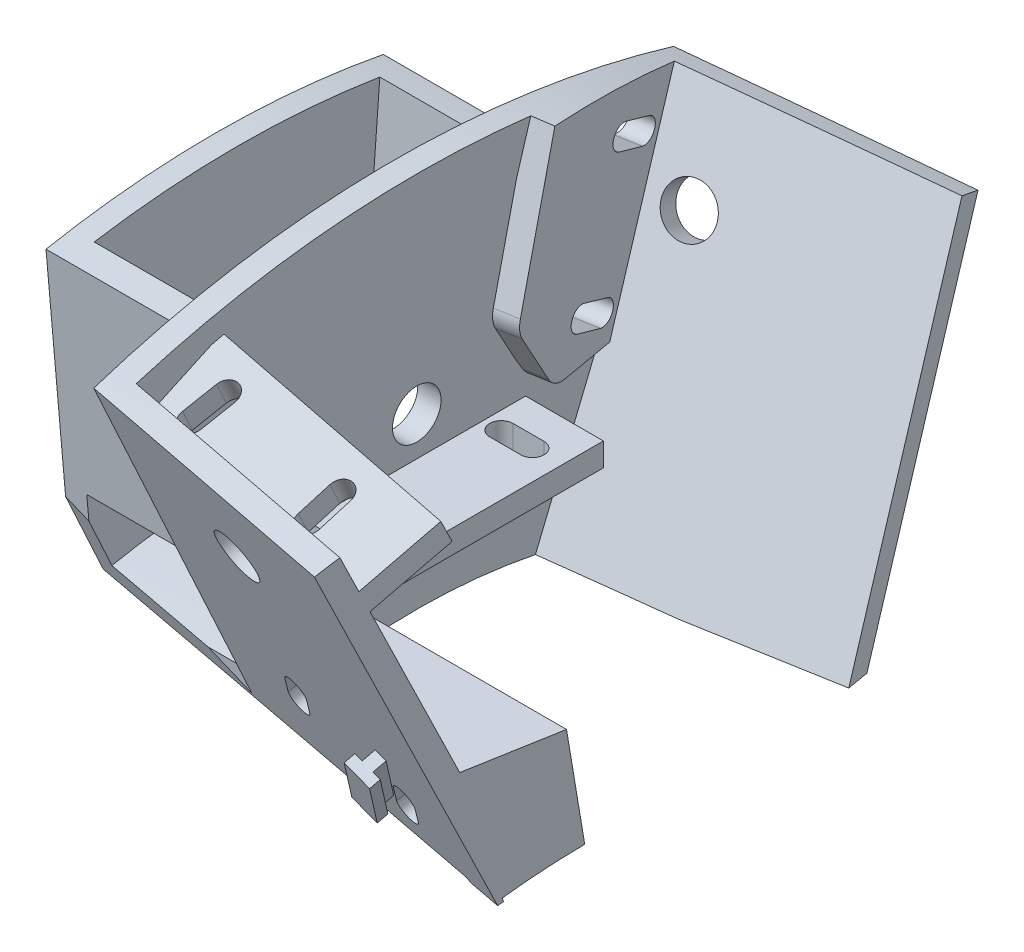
from build123d import *

# Parameters (mm, degrees)
SKETCH2_W                = 26
SKETCH2_H                = 40
SKETCH2_W_2              = 20.25
SKETCH2_H_2              = 10
SKETCH4_OUTSIDE_W        = 301.108
SKETCH4_OUTSIDE_H        = 301.108
CUT_EXTRUDE1_DEPTH       = 167.794784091
CUT_EXTRUDE4_START       = -2.875
CUT_EXTRUDE4_DEPTH       = 20.25
CUT_EXTRUDE6_DEPTH       = 120.213568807
CUT_EXTRUDE6_DEPTH_BACK  = 120.213568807
BOSS_EXTRUDE5_DEPTH      = 35
CUT_EXTRUDE12_DEPTH      = 152.632461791
CUT_EXTRUDE12_DEPTH_BACK = 152.632461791
LEFT_WALL_DEPTH          = 35
BOSS_EXTRUDE7_START      = 70
SKETCH24_W               = 3
SKETCH24_H               = 69.527102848
BOSS_EXTRUDE7_DEPTH      = 60
BOSS_EXTRUDE8_DEPTH      = 3
CUT_EXTRUDE18_DEPTH      = 149.07965626
SKETCH32_W               = 28
SKETCH32_H               = 3
BOSS_EXTRUDE9_DEPTH      = 10
BOSS_EXTRUDE10_DEPTH     = 10
CUT_EXTRUDE15_DEPTH      = 151.955185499
SKETCH35_W               = 13.835830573
SKETCH35_H               = 30.601636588
SKETCH35_W_2             = 16.655760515
SKETCH35_H_2             = 26.235193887
CUT_EXTRUDE17_DEPTH      = 10
BOSS_EXTRUDE11_REACH     = 150.08
CUT_EXTRUDE13_DEPTH      = 50
SKETCH30_OUTSIDE_W       = 124.447
SKETCH30_OUTSIDE_H       = 94.014
SKETCH30_OUTSIDE_R       = 125.002885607
SKETCH30_OUTSIDE_R_2     = 76.5
CUT_EXTRUDE16_DEPTH      = 157.680791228
SKETCH41_R               = 3.125
CUT_EXTRUDE19_DEPTH      = 20
SKETCH42_R               = 3.125
CUT_EXTRUDE20_DEPTH      = 20
FILLET1_R                = 3
CUT_EXTRUDE21_DEPTH      = 10
CUT_EXTRUDE22_DEPTH      = 10
CUT_EXTRUDE23_DEPTH      = 10
CUT_EXTRUDE24_DEPTH      = 142.664642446
BOSS_EXTRUDE13_REACH     = 143.27
SKETCH50_W               = 16.512728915
SKETCH50_H               = 3.437458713
SKETCH51_W               = 11.821329
SKETCH51_H               = 10.077198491
CUT_EXTRUDE27_DEPTH      = 10
BOSS_EXTRUDE14_DEPTH     = 1.6
BOSS_EXTRUDE15_DEPTH     = 1.3
BOSS_EXTRUDE16_DEPTH     = 1.6
CUT_EXTRUDE28_START      = 10
CUT_EXTRUDE28_DEPTH      = 10.125
SKETCH61_W               = 8.402617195
SKETCH61_H               = 15.754907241
CUT_EXTRUDE29_DEPTH      = 10
BOSS_EXTRUDE17_DEPTH     = 1.3


with BuildPart() as part:
    # Sketch2 → Revolve1 (revolve)
    with BuildSketch(Plane.XY, mode=Mode.PRIVATE) as revolve1_sk:
        with Locations((0, 96.5)):
            Rectangle(SKETCH2_W, SKETCH2_H)
        with Locations((0, 84.5)):
            Rectangle(SKETCH2_W_2, SKETCH2_H_2, mode=Mode.SUBTRACT)
    revolve(revolve1_sk.sketch.rotate(Axis((-22.5, 0, 0), (1, 0, 0)), 180), axis=Axis((-22.5, 0, 0), (1, 0, 0)))

    # Sketch4 outside → Cut-Extrude1 (cut, through all)
    with BuildSketch(Plane(origin=(13, 0, 0), x_dir=(0, 0, -1), z_dir=(1, 0, 0))):
        Rectangle(SKETCH4_OUTSIDE_W, SKETCH4_OUTSIDE_H)
        with BuildLine():
            Line((-5.001171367, -76.336349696), (-1.488138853, -116.490495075))
            ThreePointArc((-1.488138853, -116.490495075), (0, -116.5), (1.488138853, -116.490495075))
            Line((1.488138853, -116.490495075), (5.001171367, -76.336349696))
            ThreePointArc((5.001171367, -76.336349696), (0, -76.5), (-5.001171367, -76.336349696))
        make_face(mode=Mode.SUBTRACT)
        with BuildLine():
            ThreePointArc((-1.007e-06, 116.5), (-10.894690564, 115.989463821), (-21.693892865, 114.462330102))
            Line((-21.693892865, 114.462330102), (-18.180860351, 74.308184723))
            ThreePointArc((-18.180860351, 74.308184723), (0, 76.5), (18.180860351, 74.308184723))
            Line((18.180860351, 74.308184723), (21.693892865, 114.462330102))
            ThreePointArc((21.693892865, 114.462330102), (10.894689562, 115.989463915), (-1.007e-06, 116.5))
        make_face(mode=Mode.SUBTRACT)
    extrude(amount=-CUT_EXTRUDE1_DEPTH, mode=Mode.SUBTRACT)


with BuildPart() as cut_extrude1_kept_piece:
    # of the separate pieces the step leaves, the one the design keeps (cut_extrude1_pieces_kept)
    add(part.part.solids().sort_by_distance((-13, 74.308184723, -18.180860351))[0])

    # Sketch6 → Cut-Extrude4 (cut)
    with BuildSketch(Plane(origin=(13, 0, 0), x_dir=(0, 0, -1), z_dir=(1, 0, 0)).offset(CUT_EXTRUDE4_START)):
        Polygon((-19, 123.429099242), (19, 123.429099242), (16, 83.541757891), (-16, 83.541757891), align=None)
    extrude(amount=-CUT_EXTRUDE4_DEPTH, mode=Mode.SUBTRACT)

    # Sketch18 → Cut-Extrude6 (cut, two sides: drawn at the far end of the back side and taken through both)
    with BuildSketch(Plane(origin=(0, 0, 0), x_dir=(1, 0, 0), z_dir=(0, 1, 0)).offset(-CUT_EXTRUDE6_DEPTH_BACK)):
        Polygon((11.811743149, 21.693892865), (13, 14.954953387), (13, 21.693892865), align=None)
    extrude(amount=CUT_EXTRUDE6_DEPTH + CUT_EXTRUDE6_DEPTH_BACK, mode=Mode.SUBTRACT)

    # Sketch19 → Boss-Extrude5 (add)
    with BuildSketch(Plane(origin=(15.165449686, 0, -2.674077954), x_dir=(-0.1736481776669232, 0, -0.9848077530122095), z_dir=(0.9848077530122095, 0, -0.1736481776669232))):
        Polygon((40.183474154, 135.665708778), (15.424440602, 74.38495033), (12.549219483, 74.396548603), (37.183474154, 135.368468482), align=None)
    extrude(amount=BOSS_EXTRUDE5_DEPTH)

    # Sketch22 → Cut-Extrude12 (cut, two sides: drawn at the far end of the back side and taken through both)
    with BuildSketch(Plane(origin=(0, 0, 0), x_dir=(1, 0, 0), z_dir=(0, 1, 0)).offset(-CUT_EXTRUDE12_DEPTH_BACK)):
        Polygon((11.793388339, -21.693892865), (13, -14.850858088), (13, -21.693892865), align=None)
    extrude(amount=CUT_EXTRUDE12_DEPTH + CUT_EXTRUDE12_DEPTH_BACK, mode=Mode.SUBTRACT)

    # Sketch23 → Left wall (add)
    with BuildSketch(Plane(origin=(15.147648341, 0, 2.670939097), x_dir=(0.17364817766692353, 0, -0.9848077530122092), z_dir=(0.9848077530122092, 0, 0.17364817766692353))):
        Polygon((-15.792683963, 73.860354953), (-39.627705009, 126.404367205), (-36.832752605, 127.494431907), (-12.74552683, 74.394437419), align=None)
    extrude(amount=LEFT_WALL_DEPTH)

    # Sketch24 → Boss-Extrude7 (add)
    with BuildSketch(Plane(origin=(0, 0, 0), x_dir=(1, 0, 0), z_dir=(0, 1, 0)).offset(BOSS_EXTRUDE7_START)):
        with Locations((11.5, -4.655828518)):
            Rectangle(SKETCH24_W, SKETCH24_H)
    extrude(amount=BOSS_EXTRUDE7_DEPTH)

    # Sketch31 → Boss-Extrude8 (add)
    with BuildSketch(Plane(origin=(17.756725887, 0, -3.130989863), x_dir=(0, -1, 0), z_dir=(-0.9848077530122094, 0, 0.17364817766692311))):
        Polygon((-104.485728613, -6.317527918), (-94.994036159, -12.04949026), (-94.994036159, -25.449375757), (-125.588172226, -34.584217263), (-125.588172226, -12.618326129), align=None)
    extrude(amount=BOSS_EXTRUDE8_DEPTH)

    # Sketch39 → Cut-Extrude18 (cut, through all)
    with BuildSketch(Plane(origin=(13, 0, 0), x_dir=(0, 0, -1), z_dir=(1, 0, 0))):
        with BuildLine():
            ThreePointArc((0, 101.377888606), (-3.125, 98.252888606), (0, 95.127888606))
            Line((0, 95.127888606), (0, 101.377888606))
        make_face()
        with BuildLine():
            Line((0, 101.377888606), (0, 95.127888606))
            ThreePointArc((0, 95.127888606), (2.209708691, 96.043179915), (3.125, 98.252888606))
            ThreePointArc((3.125, 98.252888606), (2.209708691, 100.462597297), (0, 101.377888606))
        make_face()
        with BuildLine():
            ThreePointArc((0, 101.377888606), (-3.125, 98.252888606), (0, 95.127888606))
            Line((0, 95.127888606), (0, 101.377888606))
        make_face()
        with BuildLine():
            Line((0, 101.377888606), (0, 95.127888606))
            ThreePointArc((0, 95.127888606), (2.209708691, 96.043179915), (3.125, 98.252888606))
            ThreePointArc((3.125, 98.252888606), (2.209708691, 100.462597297), (0, 101.377888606))
        make_face()
    extrude(amount=-CUT_EXTRUDE18_DEPTH, mode=Mode.SUBTRACT)

    # Sketch32 → Boss-Extrude9 (add)
    with BuildSketch(Plane(origin=(13, 0, 0), x_dir=(0, 0, -1), z_dir=(1, 0, 0))):
        with Locations((0, 91.752888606)):
            Rectangle(SKETCH32_W, SKETCH32_H)
    extrude(amount=BOSS_EXTRUDE9_DEPTH)

    # Sketch33 → Boss-Extrude10 (add)
    with BuildSketch(Plane(origin=(3.024483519, 7.900840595, -17.152698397), x_dir=(-0.987416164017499, 0.06502780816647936, -0.14415513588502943), z_dir=(0.15813855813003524, 0.4131044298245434, -0.8968483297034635))):
        Polygon((-41.971472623, 119.276415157), (-8.893415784, 119.276415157), (-8.893415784, 116.276415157), (-42.186237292, 116.276415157), align=None)
    extrude(amount=BOSS_EXTRUDE10_DEPTH)

    # Sketch34 → Cut-Extrude15 (cut, through all)
    with BuildSketch(Plane(origin=(2.183823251, 5.081089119, 12.385077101), x_dir=(-0.9867493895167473, 0.04226969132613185, 0.15664902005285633), z_dir=(-0.16100378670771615, -0.3746065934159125, -0.9130978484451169))):
        Polygon((-64.996676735, 163.233250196), (28.868847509, 163.233250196), (20.0554099, 44.888377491), (-64.996676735, 44.888377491), align=None)
    extrude(amount=CUT_EXTRUDE15_DEPTH, mode=Mode.SUBTRACT)

    # Sketch35 → Cut-Extrude17 (cut)
    with BuildSketch(Plane.ZY.offset(-10)):
        with Locations((37.420522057, 118.087197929)):
            Rectangle(SKETCH35_W, SKETCH35_H)
        with Locations((-34.927798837, 127.887214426)):
            Rectangle(SKETCH35_W_2, SKETCH35_H_2)
    extrude(amount=CUT_EXTRUDE17_DEPTH, mode=Mode.SUBTRACT)

    # Boss-Extrude11: up to this plane
    boss_extrude11_end = Plane(origin=(49.615919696, 0, 8.748625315), z_dir=(-0.9848077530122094, 0, -0.17364817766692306))
    # Sketch38 → Boss-Extrude11 (add, up to the surface)
    with BuildSketch(Plane(origin=(13, 0, 0), x_dir=(0, 0, -1), z_dir=(1, 0, 0)), mode=Mode.PRIVATE) as boss_extrude11_sk1:
        Polygon((-13.873523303, 73.816578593), (-16.066344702, 88.816578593), (-27.743302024, 88.816578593), (-22.837790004, 72.04051603), align=None)
    boss_extrude11_tool1 = split(extrude(boss_extrude11_sk1.sketch, amount=BOSS_EXTRUDE11_REACH, mode=Mode.PRIVATE), bisect_by=boss_extrude11_end, keep=Keep.BOTH, mode=Mode.PRIVATE)
    add(boss_extrude11_tool1.solids().sort_by_distance((13, 81.154883, 20.302083))[0])

    # Sketch26 → Cut-Extrude13 (cut)
    with BuildSketch(Plane(origin=(2.55075922, 6.66333338, -14.466074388), x_dir=(0.9874155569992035, -0.06767559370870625, 0.14293541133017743), z_dir=(-0.15813855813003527, -0.4131044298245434, 0.8968483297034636))):
        Polygon((-55.362310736, 142.652923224), (75.864444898, 142.652923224), (75.864444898, 34.444242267), (-58.886066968, 34.444242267), align=None)
    extrude(amount=CUT_EXTRUDE13_DEPTH, mode=Mode.SUBTRACT)

    # Sketch30 outside → Cut-Extrude16 (cut, through all)
    # profile 1 of 2: a face of its own
    with BuildSketch(Plane.ZY.offset(13)):
        with Locations((-0.2755, 102.833)):
            Rectangle(SKETCH30_OUTSIDE_W, SKETCH30_OUTSIDE_H)
        Circle(SKETCH30_OUTSIDE_R, mode=Mode.SUBTRACT)
    # profile 2 of 2: a face of its own
    with BuildSketch(Plane.ZY.offset(13)):
        Circle(SKETCH30_OUTSIDE_R_2)
    extrude(amount=-CUT_EXTRUDE16_DEPTH, mode=Mode.SUBTRACT)


with BuildPart() as cut_extrude16_kept_piece:
    # of the separate pieces the step leaves, the one the design keeps (cut_extrude16_pieces_kept)
    add(cut_extrude1_kept_piece.part.solids().sort_by_distance((-13, 89.310237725, -19.493369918))[0])

    # Sketch41 → Cut-Extrude19 (cut)
    with BuildSketch(Plane(origin=(3.024483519, 7.900840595, -17.152698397), x_dir=(-0.9874163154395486, 0.0651456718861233, -0.144100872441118), z_dir=(0.15813855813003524, 0.4131044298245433, -0.8968483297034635))):
        with Locations(Location((-23.14514817, 111.279419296, 0), (0, 0, 90.063998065))):
            Circle(SKETCH41_R)
    extrude(amount=-CUT_EXTRUDE19_DEPTH, mode=Mode.SUBTRACT)

    # Sketch42 → Cut-Extrude20 (cut)
    with BuildSketch(Plane(origin=(2.613736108, 6.081364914, 14.823234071), x_dir=(0.9867493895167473, -0.04226969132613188, -0.15664902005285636), z_dir=(0.16100378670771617, 0.37460659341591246, 0.9130978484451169))):
        with Locations(Location((17.969619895, 111.423345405, 0), (0, 0, 268.833899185))):
            Circle(SKETCH42_R)
    extrude(amount=-CUT_EXTRUDE20_DEPTH, mode=Mode.SUBTRACT)

    # Fillet1
    fillet1_edges = [cut_extrude16_kept_piece.edges().sort_by_distance(p)[0] for p in [
        (14.332176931, 94.994036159, -14.762522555),
        (15.182487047, 104.485728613, -9.09206807),
    ]]
    fillet(fillet1_edges, radius=FILLET1_R)

    # Sketch43 → Cut-Extrude21 (cut)
    with BuildSketch(Plane(origin=(-0.143141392, 105.620730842, 48.625563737), x_dir=(0.9999992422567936, 0.0011199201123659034, 0.0005111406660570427), z_dir=(0.0012310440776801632, -0.9083590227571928, -0.4181893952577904))):
        with BuildLine():
            Line((36.36192484, -15.519667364), (36.829315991, -19.492266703))
            ThreePointArc((36.829315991, -19.492266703), (35.51486292, -21.157263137), (33.849866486, -19.842810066))
            Line((33.849866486, -19.842810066), (33.382475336, -15.870210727))
            ThreePointArc((33.382475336, -15.870210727), (34.696928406, -14.205214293), (36.36192484, -15.519667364))
        make_face()
        with BuildLine():
            Line((15.778809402, -18.853077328), (16.589138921, -22.770138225))
            ThreePointArc((16.589138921, -22.770138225), (18.361910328, -23.935162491), (19.526934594, -22.162391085))
            Line((19.526934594, -22.162391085), (18.716605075, -18.245330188))
            ThreePointArc((18.716605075, -18.245330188), (16.943833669, -17.080305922), (15.778809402, -18.853077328))
        make_face()
    extrude(amount=-CUT_EXTRUDE21_DEPTH, mode=Mode.SUBTRACT)

    # Sketch45 → Cut-Extrude22 (cut)
    with BuildSketch(Plane(origin=(0, 93.252888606, 0), x_dir=(1, 0, 0), z_dir=(0, 1, 0))):
        with BuildLine():
            Line((15.232135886, 7.142058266), (19.232135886, 7.142058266))
            ThreePointArc((19.232135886, 7.142058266), (20.732135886, 8.642058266), (19.232135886, 10.142058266))
            Line((19.232135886, 10.142058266), (15.232135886, 10.142058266))
            ThreePointArc((15.232135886, 10.142058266), (13.732135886, 8.642058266), (15.232135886, 7.142058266))
        make_face()
        with BuildLine():
            ThreePointArc((19.232135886, -7.645107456), (20.732135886, -9.145107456), (19.232135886, -10.645107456))
            Line((19.232135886, -10.645107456), (15.232135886, -10.645107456))
            ThreePointArc((15.232135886, -10.645107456), (13.732135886, -9.145107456), (15.232135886, -7.645107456))
            Line((15.232135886, -7.645107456), (19.232135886, -7.645107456))
        make_face()
    extrude(amount=-CUT_EXTRUDE22_DEPTH, mode=Mode.SUBTRACT)

    # Sketch47 → Cut-Extrude23 (cut)
    with BuildSketch(Plane(origin=(17.756725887, 0, -3.130989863), x_dir=(-0.17364817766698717, -4.2793647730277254e-14, -0.984807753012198), z_dir=(0.984807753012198, 2.426948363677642e-13, -0.17364817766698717))):
        with BuildLine():
            Line((22.326747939, 115.307778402), (26.035483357, 113.809352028))
            ThreePointArc((26.035483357, 113.809352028), (27.988169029, 114.63821792), (27.159303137, 116.590903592))
            Line((27.159303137, 116.590903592), (23.450567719, 118.089329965))
            ThreePointArc((23.450567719, 118.089329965), (21.497882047, 117.260464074), (22.326747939, 115.307778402))
        make_face()
        with BuildLine():
            ThreePointArc((20.517762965, 100.152514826), (21.346628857, 98.199829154), (19.393943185, 97.370963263))
            Line((19.393943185, 97.370963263), (15.685207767, 98.869389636))
            ThreePointArc((15.685207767, 98.869389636), (14.856341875, 100.822075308), (16.809027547, 101.6509412))
            Line((16.809027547, 101.6509412), (20.517762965, 100.152514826))
        make_face()
    extrude(amount=-CUT_EXTRUDE23_DEPTH, mode=Mode.SUBTRACT)

    # Sketch48 → Cut-Extrude24 (cut, through all)
    with BuildSketch(Plane(origin=(0, -0.44118434, 3.017922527), x_dir=(-1, 0, 0), z_dir=(0, 0.14465060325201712, -0.9894827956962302))):
        with BuildLine():
            ThreePointArc((-20.128531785, 85.299353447), (-21.057372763, 83.392194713), (-22.964531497, 84.321035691))
            Line((-22.964531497, 84.321035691), (-23.942849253, 87.157035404))
            ThreePointArc((-23.942849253, 87.157035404), (-23.014008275, 89.064194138), (-21.10684954, 88.135353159))
            Line((-21.10684954, 88.135353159), (-20.128531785, 85.299353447))
        make_face()
        with BuildLine():
            Line((-38.100774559, 82.273061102), (-37.122456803, 79.43706139))
            ThreePointArc((-37.122456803, 79.43706139), (-35.215298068, 78.508220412), (-34.28645709, 80.415379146))
            Line((-34.28645709, 80.415379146), (-35.264774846, 83.251378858))
            ThreePointArc((-35.264774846, 83.251378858), (-37.17193358, 84.180219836), (-38.100774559, 82.273061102))
        make_face()
    extrude(amount=-CUT_EXTRUDE24_DEPTH, mode=Mode.SUBTRACT)

    # Boss-Extrude13: up to this face of the body (flat: up to its plane)
    boss_extrude13_end = Plane(cut_extrude16_kept_piece.part.faces().sort_by_distance((25.947857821, 94.705708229, 30.213362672))[0])
    # Sketch50 → Boss-Extrude13 (add, up to the picked face)
    with BuildSketch(Plane(origin=(0, -0.477425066, 1.632716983), x_dir=(1, 0, 0), z_dir=(0, -0.28065869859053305, 0.9598076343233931)), mode=Mode.PRIVATE) as boss_extrude13_sk1:
        with Locations((39.363587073, 77.719134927)):
            Rectangle(SKETCH50_W, SKETCH50_H)
    boss_extrude13_tool1 = split(extrude(boss_extrude13_sk1.sketch, amount=BOSS_EXTRUDE13_REACH, mode=Mode.PRIVATE), bisect_by=boss_extrude13_end, keep=Keep.BOTH, mode=Mode.PRIVATE)
    add(boss_extrude13_tool1.solids().sort_by(Axis((39.363587, 74.117994, 23.445268), (0, -0.28065869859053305, 0.9598076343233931)))[0])

    # Sketch51 → Cut-Extrude27 (cut)
    with BuildSketch(Plane(origin=(49.615919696, 0, 8.748625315), x_dir=(0.17364817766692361, 0, -0.9848077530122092), z_dir=(0.9848077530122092, 0, 0.17364817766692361))):
        with Locations((-14.915073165, 74.85570057)):
            Rectangle(SKETCH51_W, SKETCH51_H)
    extrude(amount=CUT_EXTRUDE27_DEPTH, mode=Mode.SUBTRACT)

    # Sketch55 → Boss-Extrude14 (add)
    with BuildSketch(Plane(origin=(2.55075922, 6.66333338, -14.466074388), x_dir=(0.9874093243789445, -0.06259447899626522, 0.14527476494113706), z_dir=(-0.15813855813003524, -0.41310442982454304, 0.8968483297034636))):
        Polygon((31.020024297, 81.830026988), (32.433563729, 81.328124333), (35.277678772, 89.338181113), (33.86413934, 89.840083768), align=None)
    extrude(amount=BOSS_EXTRUDE14_DEPTH)

    # Sketch56 → Boss-Extrude15 (add)
    with BuildSketch(Plane(origin=(2.297737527, 6.002366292, -13.031117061), x_dir=(0.9874093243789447, -0.06259447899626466, 0.14527476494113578), z_dir=(-0.15813855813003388, -0.4131044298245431, 0.8968483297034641))):
        Polygon((32.921779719, 90.174685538), (30.077664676, 82.164628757), (33.37592335, 80.993522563), (36.220038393, 89.003579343), align=None)
    extrude(amount=BOSS_EXTRUDE15_DEPTH)

    # Sketch57 → Boss-Extrude16 (add)
    with BuildSketch(Plane(origin=(2.183823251, 5.081089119, 12.385077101), x_dir=(-0.9867493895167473, 0.0422696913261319, 0.15664902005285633), z_dir=(-0.16100378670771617, -0.3746065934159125, -0.9130978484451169))):
        Polygon((-30.681773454, 91.710744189), (-32.111735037, 91.257743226), (-29.544729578, 83.154627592), (-28.114767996, 83.607628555), align=None)
    extrude(amount=BOSS_EXTRUDE16_DEPTH)

    # Sketch60 → Cut-Extrude28 (cut)
    with BuildSketch(Plane(origin=(-10.125, 0, 0), x_dir=(0, 0, -1), z_dir=(1, 0, 0)).offset(CUT_EXTRUDE28_START)):
        Polygon((25.371855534, 99.842748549), (23.306413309, 94.651736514), (12.089314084, 99.114887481), (14.154756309, 104.305899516), align=None)
    extrude(amount=CUT_EXTRUDE28_DEPTH, mode=Mode.SUBTRACT)

    # Sketch61 → Cut-Extrude29 (cut)
    with BuildSketch(Plane.ZY.offset(-10)):
        with Locations((-30.88484954, 108.942415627)):
            Rectangle(SKETCH61_W, SKETCH61_H)
    extrude(amount=CUT_EXTRUDE29_DEPTH, mode=Mode.SUBTRACT)

    # Sketch62 → Boss-Extrude17 (add)
    with BuildSketch(Plane(origin=(1.926217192, 4.481718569, 10.924120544), x_dir=(-0.9869537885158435, 0.06111033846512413, 0.1489555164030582), z_dir=(-0.1610037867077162, -0.3746065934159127, -0.9130978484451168))):
        Polygon((-31.207164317, 91.609808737), (-28.805596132, 83.45613041), (-25.448199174, 84.445011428), (-27.849767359, 92.598689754), align=None)
    extrude(amount=BOSS_EXTRUDE17_DEPTH)


solid = cut_extrude16_kept_piece.part
